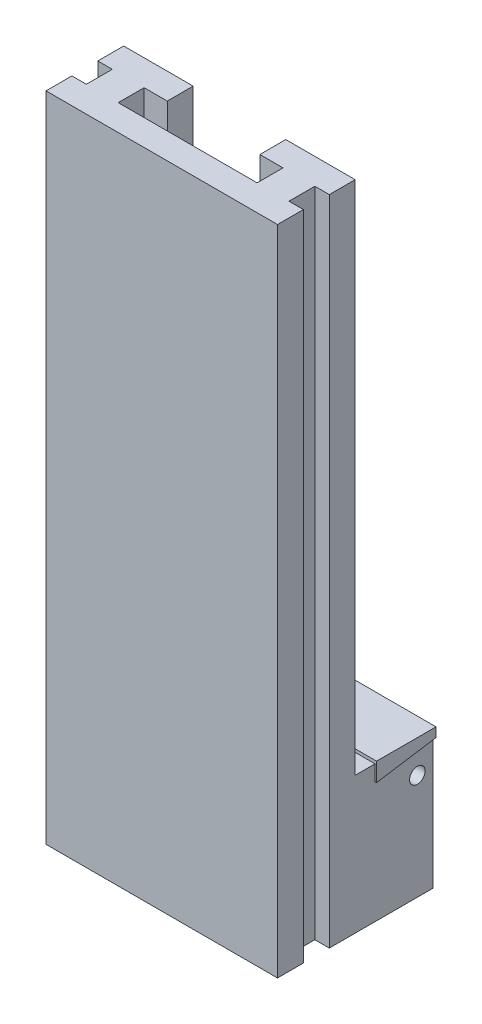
ISO-10303-21;
HEADER;
FILE_DESCRIPTION(('STEP AP214'),'2;1');
FILE_NAME('part.step','',(''),(''),'','','');
FILE_SCHEMA(('AUTOMOTIVE_DESIGN { 1 0 10303 214 1 1 1 1 }'));
ENDSEC;
DATA;
#1=APPLICATION_CONTEXT('core data for automotive mechanical design processes');
#2=APPLICATION_PROTOCOL_DEFINITION('international standard','automotive_design',2000,#1);
#3=PRODUCT_CONTEXT('',#1,'mechanical');
#4=PRODUCT('Part','Part','',(#3));
#5=PRODUCT_RELATED_PRODUCT_CATEGORY('part','',(#4));
#6=PRODUCT_DEFINITION_FORMATION('','',#4);
#7=PRODUCT_DEFINITION_CONTEXT('part definition',#1,'design');
#8=PRODUCT_DEFINITION('design','',#6,#7);
#9=PRODUCT_DEFINITION_SHAPE('','',#8);
#10=(LENGTH_UNIT() NAMED_UNIT(*) SI_UNIT(.MILLI.,.METRE.));
#11=(NAMED_UNIT(*) PLANE_ANGLE_UNIT() SI_UNIT($,.RADIAN.));
#12=(NAMED_UNIT(*) SI_UNIT($,.STERADIAN.) SOLID_ANGLE_UNIT());
#13=UNCERTAINTY_MEASURE_WITH_UNIT(LENGTH_MEASURE(1.E-05),#10,'distance_accuracy_value','');
#14=(GEOMETRIC_REPRESENTATION_CONTEXT(3) GLOBAL_UNCERTAINTY_ASSIGNED_CONTEXT((#13)) GLOBAL_UNIT_ASSIGNED_CONTEXT((#10,
#11,#12)) REPRESENTATION_CONTEXT('',''));
#15=CARTESIAN_POINT('',(0.,0.,0.));
#16=DIRECTION('',(0.,0.,1.));
#17=DIRECTION('',(1.,0.,0.));
#18=AXIS2_PLACEMENT_3D('',#15,#16,#17);
#19=CARTESIAN_POINT('',(74.5,420.,-50.));
#20=DIRECTION('',(-1.,0.,0.));
#21=DIRECTION('',(0.,0.,1.));
#22=AXIS2_PLACEMENT_3D('',#19,#20,#21);
#23=PLANE('',#22);
#24=CARTESIAN_POINT('',(74.4999999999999,68.,-90.));
#25=DIRECTION('',(-1.,0.,0.));
#26=DIRECTION('',(0.,0.,1.));
#27=AXIS2_PLACEMENT_3D('',#24,#25,#26);
#28=CIRCLE('',#27,5.00000000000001);
#29=CARTESIAN_POINT('',(74.4999999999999,68.,-85.));
#30=VERTEX_POINT('',#29);
#31=EDGE_CURVE('E244',#30,#30,#28,.T.);
#32=ORIENTED_EDGE('',*,*,#31,.T.);
#33=EDGE_LOOP('',(#32));
#34=FACE_BOUND('',#33,.T.);
#35=DIRECTION('',(0.,0.154967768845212,-0.987919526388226));
#36=VECTOR('',#35,1.);
#37=CARTESIAN_POINT('',(74.4999999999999,84.2611632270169,-102.664915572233));
#38=LINE('',#37,#36);
#39=CARTESIAN_POINT('',(74.5,78.,-62.75));
#40=VERTEX_POINT('',#39);
#41=CARTESIAN_POINT('',(74.5,83.843137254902,-100.));
#42=VERTEX_POINT('',#41);
#43=EDGE_CURVE('E46',#40,#42,#38,.T.);
#44=ORIENTED_EDGE('',*,*,#43,.F.);
#45=DIRECTION('',(0.,-1.,0.));
#46=VECTOR('',#45,1.);
#47=CARTESIAN_POINT('',(74.5,420.,-62.75));
#48=LINE('',#47,#46);
#49=CARTESIAN_POINT('',(74.5,88.,-62.75));
#50=VERTEX_POINT('',#49);
#51=EDGE_CURVE('E224',#50,#40,#48,.T.);
#52=ORIENTED_EDGE('',*,*,#51,.F.);
#53=DIRECTION('',(0.,0.,1.));
#54=VECTOR('',#53,1.);
#55=CARTESIAN_POINT('',(74.5,88.,-50.));
#56=LINE('',#55,#54);
#57=CARTESIAN_POINT('',(74.5,88.,-50.));
#58=VERTEX_POINT('',#57);
#59=EDGE_CURVE('E280',#50,#58,#56,.T.);
#60=ORIENTED_EDGE('',*,*,#59,.T.);
#61=DIRECTION('',(0.,-1.,0.));
#62=VECTOR('',#61,1.);
#63=CARTESIAN_POINT('',(74.5,420.,-50.));
#64=LINE('',#63,#62);
#65=CARTESIAN_POINT('',(74.5,420.,-50.));
#66=VERTEX_POINT('',#65);
#67=EDGE_CURVE('E406',#66,#58,#64,.T.);
#68=ORIENTED_EDGE('',*,*,#67,.F.);
#69=DIRECTION('',(0.,0.,-1.));
#70=VECTOR('',#69,1.);
#71=CARTESIAN_POINT('',(74.5,420.,-50.));
#72=LINE('',#71,#70);
#73=CARTESIAN_POINT('',(74.5,420.,-33.3333333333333));
#74=VERTEX_POINT('',#73);
#75=EDGE_CURVE('E339',#74,#66,#72,.T.);
#76=ORIENTED_EDGE('',*,*,#75,.F.);
#77=DIRECTION('',(0.,-1.,0.));
#78=VECTOR('',#77,1.);
#79=CARTESIAN_POINT('',(74.5,420.,-33.3333333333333));
#80=LINE('',#79,#78);
#81=CARTESIAN_POINT('',(74.5,0.,-33.3333333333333));
#82=VERTEX_POINT('',#81);
#83=EDGE_CURVE('E409',#74,#82,#80,.T.);
#84=ORIENTED_EDGE('',*,*,#83,.T.);
#85=DIRECTION('',(0.,0.,-1.));
#86=VECTOR('',#85,1.);
#87=CARTESIAN_POINT('',(74.5,0.,-50.));
#88=LINE('',#87,#86);
#89=CARTESIAN_POINT('',(74.5,0.,-100.));
#90=VERTEX_POINT('',#89);
#91=EDGE_CURVE('E315',#82,#90,#88,.T.);
#92=ORIENTED_EDGE('',*,*,#91,.T.);
#93=DIRECTION('',(0.,-1.,0.));
#94=VECTOR('',#93,1.);
#95=CARTESIAN_POINT('',(74.5,88.,-100.));
#96=LINE('',#95,#94);
#97=EDGE_CURVE('E299',#42,#90,#96,.T.);
#98=ORIENTED_EDGE('',*,*,#97,.F.);
#99=EDGE_LOOP('',(#44,#52,#60,#68,#76,#84,#92,#98));
#100=FACE_BOUND('',#99,.T.);
#101=ADVANCED_FACE('F31',(#34,#100),#23,.F.);
#102=CARTESIAN_POINT('',(-74.5,420.,-50.));
#103=DIRECTION('',(1.,0.,0.));
#104=DIRECTION('',(0.,0.,-1.));
#105=AXIS2_PLACEMENT_3D('',#102,#103,#104);
#106=PLANE('',#105);
#107=CARTESIAN_POINT('',(-74.5,68.,-90.));
#108=DIRECTION('',(-1.,0.,0.));
#109=DIRECTION('',(0.,0.,1.));
#110=AXIS2_PLACEMENT_3D('',#107,#108,#109);
#111=CIRCLE('',#110,5.00000000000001);
#112=CARTESIAN_POINT('',(-74.5,68.,-85.));
#113=VERTEX_POINT('',#112);
#114=EDGE_CURVE('E247',#113,#113,#111,.T.);
#115=ORIENTED_EDGE('',*,*,#114,.F.);
#116=EDGE_LOOP('',(#115));
#117=FACE_BOUND('',#116,.T.);
#118=DIRECTION('',(0.,-0.154967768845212,0.987919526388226));
#119=VECTOR('',#118,1.);
#120=CARTESIAN_POINT('',(-74.4999999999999,84.2611632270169,-102.664915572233));
#121=LINE('',#120,#119);
#122=CARTESIAN_POINT('',(-74.5,83.843137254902,-100.));
#123=VERTEX_POINT('',#122);
#124=CARTESIAN_POINT('',(-74.5,78.,-62.75));
#125=VERTEX_POINT('',#124);
#126=EDGE_CURVE('E270',#123,#125,#121,.T.);
#127=ORIENTED_EDGE('',*,*,#126,.F.);
#128=DIRECTION('',(0.,-1.,0.));
#129=VECTOR('',#128,1.);
#130=CARTESIAN_POINT('',(-74.5,88.,-100.));
#131=LINE('',#130,#129);
#132=CARTESIAN_POINT('',(-74.5,0.,-100.));
#133=VERTEX_POINT('',#132);
#134=EDGE_CURVE('E298',#123,#133,#131,.T.);
#135=ORIENTED_EDGE('',*,*,#134,.T.);
#136=DIRECTION('',(0.,0.,1.));
#137=VECTOR('',#136,1.);
#138=CARTESIAN_POINT('',(-74.5,0.,-50.));
#139=LINE('',#138,#137);
#140=CARTESIAN_POINT('',(-74.5,0.,-33.3333333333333));
#141=VERTEX_POINT('',#140);
#142=EDGE_CURVE('E318',#133,#141,#139,.T.);
#143=ORIENTED_EDGE('',*,*,#142,.T.);
#144=DIRECTION('',(0.,-1.,0.));
#145=VECTOR('',#144,1.);
#146=CARTESIAN_POINT('',(-74.5,420.,-33.3333333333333));
#147=LINE('',#146,#145);
#148=CARTESIAN_POINT('',(-74.5,420.,-33.3333333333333));
#149=VERTEX_POINT('',#148);
#150=EDGE_CURVE('E376',#149,#141,#147,.T.);
#151=ORIENTED_EDGE('',*,*,#150,.F.);
#152=DIRECTION('',(0.,0.,1.));
#153=VECTOR('',#152,1.);
#154=CARTESIAN_POINT('',(-74.5,420.,-50.));
#155=LINE('',#154,#153);
#156=CARTESIAN_POINT('',(-74.5,420.,-50.));
#157=VERTEX_POINT('',#156);
#158=EDGE_CURVE('E359',#157,#149,#155,.T.);
#159=ORIENTED_EDGE('',*,*,#158,.F.);
#160=DIRECTION('',(0.,-1.,0.));
#161=VECTOR('',#160,1.);
#162=CARTESIAN_POINT('',(-74.5,420.,-50.));
#163=LINE('',#162,#161);
#164=CARTESIAN_POINT('',(-74.5,88.,-50.));
#165=VERTEX_POINT('',#164);
#166=EDGE_CURVE('E379',#157,#165,#163,.T.);
#167=ORIENTED_EDGE('',*,*,#166,.T.);
#168=DIRECTION('',(0.,0.,-1.));
#169=VECTOR('',#168,1.);
#170=CARTESIAN_POINT('',(-74.5,88.,-50.));
#171=LINE('',#170,#169);
#172=CARTESIAN_POINT('',(-74.5,88.,-62.75));
#173=VERTEX_POINT('',#172);
#174=EDGE_CURVE('E278',#165,#173,#171,.T.);
#175=ORIENTED_EDGE('',*,*,#174,.T.);
#176=DIRECTION('',(0.,1.,0.));
#177=VECTOR('',#176,1.);
#178=CARTESIAN_POINT('',(-74.5,420.,-62.75));
#179=LINE('',#178,#177);
#180=EDGE_CURVE('E54',#125,#173,#179,.T.);
#181=ORIENTED_EDGE('',*,*,#180,.F.);
#182=EDGE_LOOP('',(#127,#135,#143,#151,#159,#167,#175,#181));
#183=FACE_BOUND('',#182,.T.);
#184=ADVANCED_FACE('F431',(#117,#183),#106,.F.);
#185=CARTESIAN_POINT('',(-74.5,88.,-100.));
#186=DIRECTION('',(0.,0.,-1.));
#187=DIRECTION('',(-1.,0.,0.));
#188=AXIS2_PLACEMENT_3D('',#185,#186,#187);
#189=PLANE('',#188);
#190=ORIENTED_EDGE('',*,*,#134,.F.);
#191=DIRECTION('',(1.,0.,0.));
#192=VECTOR('',#191,1.);
#193=CARTESIAN_POINT('',(-74.5,83.843137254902,-100.));
#194=LINE('',#193,#192);
#195=EDGE_CURVE('E11',#123,#42,#194,.T.);
#196=ORIENTED_EDGE('',*,*,#195,.T.);
#197=ORIENTED_EDGE('',*,*,#97,.T.);
#198=DIRECTION('',(1.,0.,0.));
#199=VECTOR('',#198,1.);
#200=CARTESIAN_POINT('',(-74.5,0.,-100.));
#201=LINE('',#200,#199);
#202=EDGE_CURVE('E273',#133,#90,#201,.T.);
#203=ORIENTED_EDGE('',*,*,#202,.F.);
#204=EDGE_LOOP('',(#190,#196,#197,#203));
#205=FACE_BOUND('',#204,.T.);
#206=ADVANCED_FACE('F499',(#205),#189,.T.);
#207=CARTESIAN_POINT('',(74.5,88.,-50.));
#208=DIRECTION('',(0.,-1.,0.));
#209=DIRECTION('',(0.,0.,-1.));
#210=AXIS2_PLACEMENT_3D('',#207,#208,#209);
#211=PLANE('',#210);
#212=DIRECTION('',(1.,0.,0.));
#213=VECTOR('',#212,1.);
#214=CARTESIAN_POINT('',(74.5,88.,-62.75));
#215=LINE('',#214,#213);
#216=EDGE_CURVE('E39',#173,#50,#215,.T.);
#217=ORIENTED_EDGE('',*,*,#216,.F.);
#218=ORIENTED_EDGE('',*,*,#174,.F.);
#219=DIRECTION('',(-1.,0.,0.));
#220=VECTOR('',#219,1.);
#221=CARTESIAN_POINT('',(-29.8,88.,-50.));
#222=LINE('',#221,#220);
#223=CARTESIAN_POINT('',(-29.8,88.,-50.));
#224=VERTEX_POINT('',#223);
#225=EDGE_CURVE('E276',#224,#165,#222,.T.);
#226=ORIENTED_EDGE('',*,*,#225,.F.);
#227=DIRECTION('',(0.,0.,-1.));
#228=VECTOR('',#227,1.);
#229=CARTESIAN_POINT('',(-29.8,88.,-33.3333333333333));
#230=LINE('',#229,#228);
#231=CARTESIAN_POINT('',(-29.8,88.,-33.3333333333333));
#232=VERTEX_POINT('',#231);
#233=EDGE_CURVE('E296',#232,#224,#230,.T.);
#234=ORIENTED_EDGE('',*,*,#233,.F.);
#235=DIRECTION('',(1.,0.,0.));
#236=VECTOR('',#235,1.);
#237=CARTESIAN_POINT('',(-44.7,88.,-33.3333333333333));
#238=LINE('',#237,#236);
#239=CARTESIAN_POINT('',(-44.7,88.,-33.3333333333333));
#240=VERTEX_POINT('',#239);
#241=EDGE_CURVE('E294',#240,#232,#238,.T.);
#242=ORIENTED_EDGE('',*,*,#241,.F.);
#243=DIRECTION('',(0.,0.,-1.));
#244=VECTOR('',#243,1.);
#245=CARTESIAN_POINT('',(-44.7,88.,-16.6666666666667));
#246=LINE('',#245,#244);
#247=CARTESIAN_POINT('',(-44.7,88.,-16.6666666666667));
#248=VERTEX_POINT('',#247);
#249=EDGE_CURVE('E292',#248,#240,#246,.T.);
#250=ORIENTED_EDGE('',*,*,#249,.F.);
#251=DIRECTION('',(-1.,0.,0.));
#252=VECTOR('',#251,1.);
#253=CARTESIAN_POINT('',(44.7,88.,-16.6666666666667));
#254=LINE('',#253,#252);
#255=CARTESIAN_POINT('',(44.7,88.,-16.6666666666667));
#256=VERTEX_POINT('',#255);
#257=EDGE_CURVE('E290',#256,#248,#254,.T.);
#258=ORIENTED_EDGE('',*,*,#257,.F.);
#259=DIRECTION('',(0.,0.,1.));
#260=VECTOR('',#259,1.);
#261=CARTESIAN_POINT('',(44.7,88.,-33.3333333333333));
#262=LINE('',#261,#260);
#263=CARTESIAN_POINT('',(44.7,88.,-33.3333333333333));
#264=VERTEX_POINT('',#263);
#265=EDGE_CURVE('E288',#264,#256,#262,.T.);
#266=ORIENTED_EDGE('',*,*,#265,.F.);
#267=DIRECTION('',(1.,0.,0.));
#268=VECTOR('',#267,1.);
#269=CARTESIAN_POINT('',(29.8,88.,-33.3333333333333));
#270=LINE('',#269,#268);
#271=CARTESIAN_POINT('',(29.8,88.,-33.3333333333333));
#272=VERTEX_POINT('',#271);
#273=EDGE_CURVE('E286',#272,#264,#270,.T.);
#274=ORIENTED_EDGE('',*,*,#273,.F.);
#275=DIRECTION('',(0.,0.,1.));
#276=VECTOR('',#275,1.);
#277=CARTESIAN_POINT('',(29.8,88.,-50.));
#278=LINE('',#277,#276);
#279=CARTESIAN_POINT('',(29.8,88.,-50.));
#280=VERTEX_POINT('',#279);
#281=EDGE_CURVE('E284',#280,#272,#278,.T.);
#282=ORIENTED_EDGE('',*,*,#281,.F.);
#283=DIRECTION('',(-1.,0.,0.));
#284=VECTOR('',#283,1.);
#285=CARTESIAN_POINT('',(74.5,88.,-50.));
#286=LINE('',#285,#284);
#287=EDGE_CURVE('E282',#58,#280,#286,.T.);
#288=ORIENTED_EDGE('',*,*,#287,.F.);
#289=ORIENTED_EDGE('',*,*,#59,.F.);
#290=EDGE_LOOP('',(#217,#218,#226,#234,#242,#250,#258,#266,#274,#282,#288,#289));
#291=FACE_BOUND('',#290,.T.);
#292=ADVANCED_FACE('F428',(#291),#211,.F.);
#293=CARTESIAN_POINT('',(29.8,420.,-50.));
#294=DIRECTION('',(0.,0.,1.));
#295=DIRECTION('',(1.,0.,0.));
#296=AXIS2_PLACEMENT_3D('',#293,#294,#295);
#297=PLANE('',#296);
#298=ORIENTED_EDGE('',*,*,#287,.T.);
#299=DIRECTION('',(0.,-1.,0.));
#300=VECTOR('',#299,1.);
#301=CARTESIAN_POINT('',(29.8,420.,-50.));
#302=LINE('',#301,#300);
#303=CARTESIAN_POINT('',(29.8,420.,-50.));
#304=VERTEX_POINT('',#303);
#305=EDGE_CURVE('E403',#304,#280,#302,.T.);
#306=ORIENTED_EDGE('',*,*,#305,.F.);
#307=DIRECTION('',(-1.,0.,0.));
#308=VECTOR('',#307,1.);
#309=CARTESIAN_POINT('',(29.8,420.,-50.));
#310=LINE('',#309,#308);
#311=EDGE_CURVE('E341',#66,#304,#310,.T.);
#312=ORIENTED_EDGE('',*,*,#311,.F.);
#313=ORIENTED_EDGE('',*,*,#67,.T.);
#314=EDGE_LOOP('',(#298,#306,#312,#313));
#315=FACE_BOUND('',#314,.T.);
#316=ADVANCED_FACE('F476',(#315),#297,.F.);
#317=CARTESIAN_POINT('',(29.8,420.,-33.3333333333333));
#318=DIRECTION('',(1.,0.,0.));
#319=DIRECTION('',(0.,0.,-1.));
#320=AXIS2_PLACEMENT_3D('',#317,#318,#319);
#321=PLANE('',#320);
#322=ORIENTED_EDGE('',*,*,#281,.T.);
#323=DIRECTION('',(0.,-1.,0.));
#324=VECTOR('',#323,1.);
#325=CARTESIAN_POINT('',(29.8,420.,-33.3333333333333));
#326=LINE('',#325,#324);
#327=CARTESIAN_POINT('',(29.8,420.,-33.3333333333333));
#328=VERTEX_POINT('',#327);
#329=EDGE_CURVE('E400',#328,#272,#326,.T.);
#330=ORIENTED_EDGE('',*,*,#329,.F.);
#331=DIRECTION('',(0.,0.,1.));
#332=VECTOR('',#331,1.);
#333=CARTESIAN_POINT('',(29.8,420.,-33.3333333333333));
#334=LINE('',#333,#332);
#335=EDGE_CURVE('E343',#304,#328,#334,.T.);
#336=ORIENTED_EDGE('',*,*,#335,.F.);
#337=ORIENTED_EDGE('',*,*,#305,.T.);
#338=EDGE_LOOP('',(#322,#330,#336,#337));
#339=FACE_BOUND('',#338,.T.);
#340=ADVANCED_FACE('F471',(#339),#321,.F.);
#341=CARTESIAN_POINT('',(44.7,420.,-33.3333333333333));
#342=DIRECTION('',(0.,0.,-1.));
#343=DIRECTION('',(-1.,0.,0.));
#344=AXIS2_PLACEMENT_3D('',#341,#342,#343);
#345=PLANE('',#344);
#346=ORIENTED_EDGE('',*,*,#273,.T.);
#347=DIRECTION('',(0.,-1.,0.));
#348=VECTOR('',#347,1.);
#349=CARTESIAN_POINT('',(44.7,420.,-33.3333333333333));
#350=LINE('',#349,#348);
#351=CARTESIAN_POINT('',(44.7,420.,-33.3333333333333));
#352=VERTEX_POINT('',#351);
#353=EDGE_CURVE('E397',#352,#264,#350,.T.);
#354=ORIENTED_EDGE('',*,*,#353,.F.);
#355=DIRECTION('',(1.,0.,0.));
#356=VECTOR('',#355,1.);
#357=CARTESIAN_POINT('',(44.7,420.,-33.3333333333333));
#358=LINE('',#357,#356);
#359=EDGE_CURVE('E345',#328,#352,#358,.T.);
#360=ORIENTED_EDGE('',*,*,#359,.F.);
#361=ORIENTED_EDGE('',*,*,#329,.T.);
#362=EDGE_LOOP('',(#346,#354,#360,#361));
#363=FACE_BOUND('',#362,.T.);
#364=ADVANCED_FACE('F467',(#363),#345,.F.);
#365=CARTESIAN_POINT('',(44.7,420.,-16.6666666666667));
#366=DIRECTION('',(1.,0.,0.));
#367=DIRECTION('',(0.,0.,-1.));
#368=AXIS2_PLACEMENT_3D('',#365,#366,#367);
#369=PLANE('',#368);
#370=ORIENTED_EDGE('',*,*,#265,.T.);
#371=DIRECTION('',(0.,-1.,0.));
#372=VECTOR('',#371,1.);
#373=CARTESIAN_POINT('',(44.7,420.,-16.6666666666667));
#374=LINE('',#373,#372);
#375=CARTESIAN_POINT('',(44.7,420.,-16.6666666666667));
#376=VERTEX_POINT('',#375);
#377=EDGE_CURVE('E394',#376,#256,#374,.T.);
#378=ORIENTED_EDGE('',*,*,#377,.F.);
#379=DIRECTION('',(0.,0.,1.));
#380=VECTOR('',#379,1.);
#381=CARTESIAN_POINT('',(44.7,420.,-16.6666666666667));
#382=LINE('',#381,#380);
#383=EDGE_CURVE('E347',#352,#376,#382,.T.);
#384=ORIENTED_EDGE('',*,*,#383,.F.);
#385=ORIENTED_EDGE('',*,*,#353,.T.);
#386=EDGE_LOOP('',(#370,#378,#384,#385));
#387=FACE_BOUND('',#386,.T.);
#388=ADVANCED_FACE('F463',(#387),#369,.F.);
#389=CARTESIAN_POINT('',(44.7,420.,-16.6666666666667));
#390=DIRECTION('',(0.,0.,1.));
#391=DIRECTION('',(1.,0.,0.));
#392=AXIS2_PLACEMENT_3D('',#389,#390,#391);
#393=PLANE('',#392);
#394=ORIENTED_EDGE('',*,*,#257,.T.);
#395=DIRECTION('',(0.,-1.,0.));
#396=VECTOR('',#395,1.);
#397=CARTESIAN_POINT('',(-44.7,420.,-16.6666666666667));
#398=LINE('',#397,#396);
#399=CARTESIAN_POINT('',(-44.7,420.,-16.6666666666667));
#400=VERTEX_POINT('',#399);
#401=EDGE_CURVE('E391',#400,#248,#398,.T.);
#402=ORIENTED_EDGE('',*,*,#401,.F.);
#403=DIRECTION('',(-1.,0.,0.));
#404=VECTOR('',#403,1.);
#405=CARTESIAN_POINT('',(44.7,420.,-16.6666666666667));
#406=LINE('',#405,#404);
#407=EDGE_CURVE('E349',#376,#400,#406,.T.);
#408=ORIENTED_EDGE('',*,*,#407,.F.);
#409=ORIENTED_EDGE('',*,*,#377,.T.);
#410=EDGE_LOOP('',(#394,#402,#408,#409));
#411=FACE_BOUND('',#410,.T.);
#412=ADVANCED_FACE('F458',(#411),#393,.F.);
#413=CARTESIAN_POINT('',(-44.7,420.,-16.6666666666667));
#414=DIRECTION('',(-1.,0.,0.));
#415=DIRECTION('',(0.,0.,1.));
#416=AXIS2_PLACEMENT_3D('',#413,#414,#415);
#417=PLANE('',#416);
#418=ORIENTED_EDGE('',*,*,#249,.T.);
#419=DIRECTION('',(0.,-1.,0.));
#420=VECTOR('',#419,1.);
#421=CARTESIAN_POINT('',(-44.7,420.,-33.3333333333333));
#422=LINE('',#421,#420);
#423=CARTESIAN_POINT('',(-44.7,420.,-33.3333333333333));
#424=VERTEX_POINT('',#423);
#425=EDGE_CURVE('E388',#424,#240,#422,.T.);
#426=ORIENTED_EDGE('',*,*,#425,.F.);
#427=DIRECTION('',(0.,0.,-1.));
#428=VECTOR('',#427,1.);
#429=CARTESIAN_POINT('',(-44.7,420.,-16.6666666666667));
#430=LINE('',#429,#428);
#431=EDGE_CURVE('E351',#400,#424,#430,.T.);
#432=ORIENTED_EDGE('',*,*,#431,.F.);
#433=ORIENTED_EDGE('',*,*,#401,.T.);
#434=EDGE_LOOP('',(#418,#426,#432,#433));
#435=FACE_BOUND('',#434,.T.);
#436=ADVANCED_FACE('F452',(#435),#417,.F.);
#437=CARTESIAN_POINT('',(-44.7,420.,-33.3333333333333));
#438=DIRECTION('',(0.,0.,-1.));
#439=DIRECTION('',(-1.,0.,0.));
#440=AXIS2_PLACEMENT_3D('',#437,#438,#439);
#441=PLANE('',#440);
#442=ORIENTED_EDGE('',*,*,#241,.T.);
#443=DIRECTION('',(0.,-1.,0.));
#444=VECTOR('',#443,1.);
#445=CARTESIAN_POINT('',(-29.8,420.,-33.3333333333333));
#446=LINE('',#445,#444);
#447=CARTESIAN_POINT('',(-29.8,420.,-33.3333333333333));
#448=VERTEX_POINT('',#447);
#449=EDGE_CURVE('E385',#448,#232,#446,.T.);
#450=ORIENTED_EDGE('',*,*,#449,.F.);
#451=DIRECTION('',(1.,0.,0.));
#452=VECTOR('',#451,1.);
#453=CARTESIAN_POINT('',(-44.7,420.,-33.3333333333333));
#454=LINE('',#453,#452);
#455=EDGE_CURVE('E353',#424,#448,#454,.T.);
#456=ORIENTED_EDGE('',*,*,#455,.F.);
#457=ORIENTED_EDGE('',*,*,#425,.T.);
#458=EDGE_LOOP('',(#442,#450,#456,#457));
#459=FACE_BOUND('',#458,.T.);
#460=ADVANCED_FACE('F448',(#459),#441,.F.);
#461=CARTESIAN_POINT('',(-29.8,420.,-33.3333333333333));
#462=DIRECTION('',(-1.,0.,0.));
#463=DIRECTION('',(0.,0.,1.));
#464=AXIS2_PLACEMENT_3D('',#461,#462,#463);
#465=PLANE('',#464);
#466=ORIENTED_EDGE('',*,*,#233,.T.);
#467=DIRECTION('',(0.,-1.,0.));
#468=VECTOR('',#467,1.);
#469=CARTESIAN_POINT('',(-29.8,420.,-50.));
#470=LINE('',#469,#468);
#471=CARTESIAN_POINT('',(-29.8,420.,-50.));
#472=VERTEX_POINT('',#471);
#473=EDGE_CURVE('E382',#472,#224,#470,.T.);
#474=ORIENTED_EDGE('',*,*,#473,.F.);
#475=DIRECTION('',(0.,0.,-1.));
#476=VECTOR('',#475,1.);
#477=CARTESIAN_POINT('',(-29.8,420.,-33.3333333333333));
#478=LINE('',#477,#476);
#479=EDGE_CURVE('E355',#448,#472,#478,.T.);
#480=ORIENTED_EDGE('',*,*,#479,.F.);
#481=ORIENTED_EDGE('',*,*,#449,.T.);
#482=EDGE_LOOP('',(#466,#474,#480,#481));
#483=FACE_BOUND('',#482,.T.);
#484=ADVANCED_FACE('F443',(#483),#465,.F.);
#485=CARTESIAN_POINT('',(-29.8,420.,-50.));
#486=DIRECTION('',(0.,0.,1.));
#487=DIRECTION('',(1.,0.,0.));
#488=AXIS2_PLACEMENT_3D('',#485,#486,#487);
#489=PLANE('',#488);
#490=ORIENTED_EDGE('',*,*,#225,.T.);
#491=ORIENTED_EDGE('',*,*,#166,.F.);
#492=DIRECTION('',(-1.,0.,0.));
#493=VECTOR('',#492,1.);
#494=CARTESIAN_POINT('',(-29.8,420.,-50.));
#495=LINE('',#494,#493);
#496=EDGE_CURVE('E357',#472,#157,#495,.T.);
#497=ORIENTED_EDGE('',*,*,#496,.F.);
#498=ORIENTED_EDGE('',*,*,#473,.T.);
#499=EDGE_LOOP('',(#490,#491,#497,#498));
#500=FACE_BOUND('',#499,.T.);
#501=ADVANCED_FACE('F437',(#500),#489,.F.);
#502=CARTESIAN_POINT('',(-74.5,420.,-16.6666666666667));
#503=DIRECTION('',(1.,0.,0.));
#504=DIRECTION('',(0.,0.,-1.));
#505=AXIS2_PLACEMENT_3D('',#502,#503,#504);
#506=PLANE('',#505);
#507=DIRECTION('',(0.,0.,1.));
#508=VECTOR('',#507,1.);
#509=CARTESIAN_POINT('',(-74.5,0.,-16.6666666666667));
#510=LINE('',#509,#508);
#511=CARTESIAN_POINT('',(-74.5,0.,-16.6666666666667));
#512=VERTEX_POINT('',#511);
#513=CARTESIAN_POINT('',(-74.5,0.,0.));
#514=VERTEX_POINT('',#513);
#515=EDGE_CURVE('E301',#512,#514,#510,.T.);
#516=ORIENTED_EDGE('',*,*,#515,.T.);
#517=DIRECTION('',(0.,-1.,0.));
#518=VECTOR('',#517,1.);
#519=CARTESIAN_POINT('',(-74.5,420.,0.));
#520=LINE('',#519,#518);
#521=CARTESIAN_POINT('',(-74.5,420.,0.));
#522=VERTEX_POINT('',#521);
#523=EDGE_CURVE('E424',#522,#514,#520,.T.);
#524=ORIENTED_EDGE('',*,*,#523,.F.);
#525=DIRECTION('',(0.,0.,1.));
#526=VECTOR('',#525,1.);
#527=CARTESIAN_POINT('',(-74.5,420.,-16.6666666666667));
#528=LINE('',#527,#526);
#529=CARTESIAN_POINT('',(-74.5,420.,-16.6666666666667));
#530=VERTEX_POINT('',#529);
#531=EDGE_CURVE('E326',#530,#522,#528,.T.);
#532=ORIENTED_EDGE('',*,*,#531,.F.);
#533=DIRECTION('',(0.,-1.,0.));
#534=VECTOR('',#533,1.);
#535=CARTESIAN_POINT('',(-74.5,420.,-16.6666666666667));
#536=LINE('',#535,#534);
#537=EDGE_CURVE('E367',#530,#512,#536,.T.);
#538=ORIENTED_EDGE('',*,*,#537,.T.);
#539=EDGE_LOOP('',(#516,#524,#532,#538));
#540=FACE_BOUND('',#539,.T.);
#541=ADVANCED_FACE('F33',(#540),#506,.F.);
#542=CARTESIAN_POINT('',(-74.5,420.,0.));
#543=DIRECTION('',(0.,0.,-1.));
#544=DIRECTION('',(-1.,0.,0.));
#545=AXIS2_PLACEMENT_3D('',#542,#543,#544);
#546=PLANE('',#545);
#547=DIRECTION('',(1.,0.,0.));
#548=VECTOR('',#547,1.);
#549=CARTESIAN_POINT('',(-74.5,0.,0.));
#550=LINE('',#549,#548);
#551=CARTESIAN_POINT('',(74.5,0.,0.));
#552=VERTEX_POINT('',#551);
#553=EDGE_CURVE('E305',#514,#552,#550,.T.);
#554=ORIENTED_EDGE('',*,*,#553,.T.);
#555=DIRECTION('',(0.,-1.,0.));
#556=VECTOR('',#555,1.);
#557=CARTESIAN_POINT('',(74.5,420.,0.));
#558=LINE('',#557,#556);
#559=CARTESIAN_POINT('',(74.5,420.,0.));
#560=VERTEX_POINT('',#559);
#561=EDGE_CURVE('E421',#560,#552,#558,.T.);
#562=ORIENTED_EDGE('',*,*,#561,.F.);
#563=DIRECTION('',(1.,0.,0.));
#564=VECTOR('',#563,1.);
#565=CARTESIAN_POINT('',(-74.5,420.,0.));
#566=LINE('',#565,#564);
#567=EDGE_CURVE('E329',#522,#560,#566,.T.);
#568=ORIENTED_EDGE('',*,*,#567,.F.);
#569=ORIENTED_EDGE('',*,*,#523,.T.);
#570=EDGE_LOOP('',(#554,#562,#568,#569));
#571=FACE_BOUND('',#570,.T.);
#572=ADVANCED_FACE('F520',(#571),#546,.F.);
#573=CARTESIAN_POINT('',(74.5,420.,-16.6666666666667));
#574=DIRECTION('',(-1.,0.,0.));
#575=DIRECTION('',(0.,0.,1.));
#576=AXIS2_PLACEMENT_3D('',#573,#574,#575);
#577=PLANE('',#576);
#578=DIRECTION('',(0.,0.,-1.));
#579=VECTOR('',#578,1.);
#580=CARTESIAN_POINT('',(74.5,0.,-16.6666666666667));
#581=LINE('',#580,#579);
#582=CARTESIAN_POINT('',(74.5,0.,-16.6666666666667));
#583=VERTEX_POINT('',#582);
#584=EDGE_CURVE('E307',#552,#583,#581,.T.);
#585=ORIENTED_EDGE('',*,*,#584,.T.);
#586=DIRECTION('',(0.,-1.,0.));
#587=VECTOR('',#586,1.);
#588=CARTESIAN_POINT('',(74.5,420.,-16.6666666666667));
#589=LINE('',#588,#587);
#590=CARTESIAN_POINT('',(74.5,420.,-16.6666666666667));
#591=VERTEX_POINT('',#590);
#592=EDGE_CURVE('E418',#591,#583,#589,.T.);
#593=ORIENTED_EDGE('',*,*,#592,.F.);
#594=DIRECTION('',(0.,0.,-1.));
#595=VECTOR('',#594,1.);
#596=CARTESIAN_POINT('',(74.5,420.,-16.6666666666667));
#597=LINE('',#596,#595);
#598=EDGE_CURVE('E331',#560,#591,#597,.T.);
#599=ORIENTED_EDGE('',*,*,#598,.F.);
#600=ORIENTED_EDGE('',*,*,#561,.T.);
#601=EDGE_LOOP('',(#585,#593,#599,#600));
#602=FACE_BOUND('',#601,.T.);
#603=ADVANCED_FACE('F527',(#602),#577,.F.);
#604=CARTESIAN_POINT('',(65.1875,420.,-16.6666666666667));
#605=DIRECTION('',(0.,0.,1.));
#606=DIRECTION('',(1.,0.,0.));
#607=AXIS2_PLACEMENT_3D('',#604,#605,#606);
#608=PLANE('',#607);
#609=DIRECTION('',(-1.,0.,0.));
#610=VECTOR('',#609,1.);
#611=CARTESIAN_POINT('',(65.1875,0.,-16.6666666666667));
#612=LINE('',#611,#610);
#613=CARTESIAN_POINT('',(65.1875,0.,-16.6666666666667));
#614=VERTEX_POINT('',#613);
#615=EDGE_CURVE('E309',#583,#614,#612,.T.);
#616=ORIENTED_EDGE('',*,*,#615,.T.);
#617=DIRECTION('',(0.,-1.,0.));
#618=VECTOR('',#617,1.);
#619=CARTESIAN_POINT('',(65.1875,420.,-16.6666666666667));
#620=LINE('',#619,#618);
#621=CARTESIAN_POINT('',(65.1875,420.,-16.6666666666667));
#622=VERTEX_POINT('',#621);
#623=EDGE_CURVE('E415',#622,#614,#620,.T.);
#624=ORIENTED_EDGE('',*,*,#623,.F.);
#625=DIRECTION('',(-1.,0.,0.));
#626=VECTOR('',#625,1.);
#627=CARTESIAN_POINT('',(65.1875,420.,-16.6666666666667));
#628=LINE('',#627,#626);
#629=EDGE_CURVE('E333',#591,#622,#628,.T.);
#630=ORIENTED_EDGE('',*,*,#629,.F.);
#631=ORIENTED_EDGE('',*,*,#592,.T.);
#632=EDGE_LOOP('',(#616,#624,#630,#631));
#633=FACE_BOUND('',#632,.T.);
#634=ADVANCED_FACE('F530',(#633),#608,.F.);
#635=CARTESIAN_POINT('',(65.1875,420.,-33.3333333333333));
#636=DIRECTION('',(-1.,0.,0.));
#637=DIRECTION('',(0.,0.,1.));
#638=AXIS2_PLACEMENT_3D('',#635,#636,#637);
#639=PLANE('',#638);
#640=DIRECTION('',(0.,0.,-1.));
#641=VECTOR('',#640,1.);
#642=CARTESIAN_POINT('',(65.1875,0.,-33.3333333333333));
#643=LINE('',#642,#641);
#644=CARTESIAN_POINT('',(65.1875,0.,-33.3333333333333));
#645=VERTEX_POINT('',#644);
#646=EDGE_CURVE('E311',#614,#645,#643,.T.);
#647=ORIENTED_EDGE('',*,*,#646,.T.);
#648=DIRECTION('',(0.,-1.,0.));
#649=VECTOR('',#648,1.);
#650=CARTESIAN_POINT('',(65.1875,420.,-33.3333333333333));
#651=LINE('',#650,#649);
#652=CARTESIAN_POINT('',(65.1875,420.,-33.3333333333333));
#653=VERTEX_POINT('',#652);
#654=EDGE_CURVE('E412',#653,#645,#651,.T.);
#655=ORIENTED_EDGE('',*,*,#654,.F.);
#656=DIRECTION('',(0.,0.,-1.));
#657=VECTOR('',#656,1.);
#658=CARTESIAN_POINT('',(65.1875,420.,-33.3333333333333));
#659=LINE('',#658,#657);
#660=EDGE_CURVE('E335',#622,#653,#659,.T.);
#661=ORIENTED_EDGE('',*,*,#660,.F.);
#662=ORIENTED_EDGE('',*,*,#623,.T.);
#663=EDGE_LOOP('',(#647,#655,#661,#662));
#664=FACE_BOUND('',#663,.T.);
#665=ADVANCED_FACE('F532',(#664),#639,.F.);
#666=CARTESIAN_POINT('',(74.5,420.,-33.3333333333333));
#667=DIRECTION('',(0.,0.,-1.));
#668=DIRECTION('',(-1.,0.,0.));
#669=AXIS2_PLACEMENT_3D('',#666,#667,#668);
#670=PLANE('',#669);
#671=DIRECTION('',(1.,0.,0.));
#672=VECTOR('',#671,1.);
#673=CARTESIAN_POINT('',(74.5,0.,-33.3333333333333));
#674=LINE('',#673,#672);
#675=EDGE_CURVE('E313',#645,#82,#674,.T.);
#676=ORIENTED_EDGE('',*,*,#675,.T.);
#677=ORIENTED_EDGE('',*,*,#83,.F.);
#678=DIRECTION('',(1.,0.,0.));
#679=VECTOR('',#678,1.);
#680=CARTESIAN_POINT('',(74.5,420.,-33.3333333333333));
#681=LINE('',#680,#679);
#682=EDGE_CURVE('E337',#653,#74,#681,.T.);
#683=ORIENTED_EDGE('',*,*,#682,.F.);
#684=ORIENTED_EDGE('',*,*,#654,.T.);
#685=EDGE_LOOP('',(#676,#677,#683,#684));
#686=FACE_BOUND('',#685,.T.);
#687=ADVANCED_FACE('F487',(#686),#670,.F.);
#688=CARTESIAN_POINT('',(-74.5,420.,-33.3333333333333));
#689=DIRECTION('',(0.,0.,-1.));
#690=DIRECTION('',(-1.,0.,0.));
#691=AXIS2_PLACEMENT_3D('',#688,#689,#690);
#692=PLANE('',#691);
#693=DIRECTION('',(1.,0.,0.));
#694=VECTOR('',#693,1.);
#695=CARTESIAN_POINT('',(-74.5,0.,-33.3333333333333));
#696=LINE('',#695,#694);
#697=CARTESIAN_POINT('',(-65.1875,0.,-33.3333333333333));
#698=VERTEX_POINT('',#697);
#699=EDGE_CURVE('E320',#141,#698,#696,.T.);
#700=ORIENTED_EDGE('',*,*,#699,.T.);
#701=DIRECTION('',(0.,-1.,0.));
#702=VECTOR('',#701,1.);
#703=CARTESIAN_POINT('',(-65.1875,420.,-33.3333333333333));
#704=LINE('',#703,#702);
#705=CARTESIAN_POINT('',(-65.1875,420.,-33.3333333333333));
#706=VERTEX_POINT('',#705);
#707=EDGE_CURVE('E373',#706,#698,#704,.T.);
#708=ORIENTED_EDGE('',*,*,#707,.F.);
#709=DIRECTION('',(1.,0.,0.));
#710=VECTOR('',#709,1.);
#711=CARTESIAN_POINT('',(-74.5,420.,-33.3333333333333));
#712=LINE('',#711,#710);
#713=EDGE_CURVE('E361',#149,#706,#712,.T.);
#714=ORIENTED_EDGE('',*,*,#713,.F.);
#715=ORIENTED_EDGE('',*,*,#150,.T.);
#716=EDGE_LOOP('',(#700,#708,#714,#715));
#717=FACE_BOUND('',#716,.T.);
#718=ADVANCED_FACE('F505',(#717),#692,.F.);
#719=CARTESIAN_POINT('',(-65.1875,420.,-33.3333333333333));
#720=DIRECTION('',(1.,0.,0.));
#721=DIRECTION('',(0.,0.,-1.));
#722=AXIS2_PLACEMENT_3D('',#719,#720,#721);
#723=PLANE('',#722);
#724=DIRECTION('',(0.,0.,1.));
#725=VECTOR('',#724,1.);
#726=CARTESIAN_POINT('',(-65.1875,0.,-33.3333333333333));
#727=LINE('',#726,#725);
#728=CARTESIAN_POINT('',(-65.1875,0.,-16.6666666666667));
#729=VERTEX_POINT('',#728);
#730=EDGE_CURVE('E322',#698,#729,#727,.T.);
#731=ORIENTED_EDGE('',*,*,#730,.T.);
#732=DIRECTION('',(0.,-1.,0.));
#733=VECTOR('',#732,1.);
#734=CARTESIAN_POINT('',(-65.1875,420.,-16.6666666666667));
#735=LINE('',#734,#733);
#736=CARTESIAN_POINT('',(-65.1875,420.,-16.6666666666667));
#737=VERTEX_POINT('',#736);
#738=EDGE_CURVE('E370',#737,#729,#735,.T.);
#739=ORIENTED_EDGE('',*,*,#738,.F.);
#740=DIRECTION('',(0.,0.,1.));
#741=VECTOR('',#740,1.);
#742=CARTESIAN_POINT('',(-65.1875,420.,-33.3333333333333));
#743=LINE('',#742,#741);
#744=EDGE_CURVE('E363',#706,#737,#743,.T.);
#745=ORIENTED_EDGE('',*,*,#744,.F.);
#746=ORIENTED_EDGE('',*,*,#707,.T.);
#747=EDGE_LOOP('',(#731,#739,#745,#746));
#748=FACE_BOUND('',#747,.T.);
#749=ADVANCED_FACE('F509',(#748),#723,.F.);
#750=CARTESIAN_POINT('',(-65.1875,420.,-16.6666666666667));
#751=DIRECTION('',(0.,0.,1.));
#752=DIRECTION('',(1.,0.,0.));
#753=AXIS2_PLACEMENT_3D('',#750,#751,#752);
#754=PLANE('',#753);
#755=DIRECTION('',(-1.,0.,0.));
#756=VECTOR('',#755,1.);
#757=CARTESIAN_POINT('',(-65.1875,0.,-16.6666666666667));
#758=LINE('',#757,#756);
#759=EDGE_CURVE('E324',#729,#512,#758,.T.);
#760=ORIENTED_EDGE('',*,*,#759,.T.);
#761=ORIENTED_EDGE('',*,*,#537,.F.);
#762=DIRECTION('',(-1.,0.,0.));
#763=VECTOR('',#762,1.);
#764=CARTESIAN_POINT('',(-65.1875,420.,-16.6666666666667));
#765=LINE('',#764,#763);
#766=EDGE_CURVE('E365',#737,#530,#765,.T.);
#767=ORIENTED_EDGE('',*,*,#766,.F.);
#768=ORIENTED_EDGE('',*,*,#738,.T.);
#769=EDGE_LOOP('',(#760,#761,#767,#768));
#770=FACE_BOUND('',#769,.T.);
#771=ADVANCED_FACE('F516',(#770),#754,.F.);
#772=CARTESIAN_POINT('',(-74.5,420.,0.));
#773=DIRECTION('',(0.,1.,0.));
#774=DIRECTION('',(0.,0.,1.));
#775=AXIS2_PLACEMENT_3D('',#772,#773,#774);
#776=PLANE('',#775);
#777=ORIENTED_EDGE('',*,*,#531,.T.);
#778=ORIENTED_EDGE('',*,*,#567,.T.);
#779=ORIENTED_EDGE('',*,*,#598,.T.);
#780=ORIENTED_EDGE('',*,*,#629,.T.);
#781=ORIENTED_EDGE('',*,*,#660,.T.);
#782=ORIENTED_EDGE('',*,*,#682,.T.);
#783=ORIENTED_EDGE('',*,*,#75,.T.);
#784=ORIENTED_EDGE('',*,*,#311,.T.);
#785=ORIENTED_EDGE('',*,*,#335,.T.);
#786=ORIENTED_EDGE('',*,*,#359,.T.);
#787=ORIENTED_EDGE('',*,*,#383,.T.);
#788=ORIENTED_EDGE('',*,*,#407,.T.);
#789=ORIENTED_EDGE('',*,*,#431,.T.);
#790=ORIENTED_EDGE('',*,*,#455,.T.);
#791=ORIENTED_EDGE('',*,*,#479,.T.);
#792=ORIENTED_EDGE('',*,*,#496,.T.);
#793=ORIENTED_EDGE('',*,*,#158,.T.);
#794=ORIENTED_EDGE('',*,*,#713,.T.);
#795=ORIENTED_EDGE('',*,*,#744,.T.);
#796=ORIENTED_EDGE('',*,*,#766,.T.);
#797=EDGE_LOOP('',(#777,#778,#779,#780,#781,#782,#783,#784,#785,#786,#787,#788,#789,#790,#791,
#792,#793,#794,#795,#796));
#798=FACE_BOUND('',#797,.T.);
#799=ADVANCED_FACE('F482',(#798),#776,.T.);
#800=CARTESIAN_POINT('',(-74.5,0.,0.));
#801=DIRECTION('',(0.,1.,0.));
#802=DIRECTION('',(0.,0.,1.));
#803=AXIS2_PLACEMENT_3D('',#800,#801,#802);
#804=PLANE('',#803);
#805=ORIENTED_EDGE('',*,*,#142,.F.);
#806=ORIENTED_EDGE('',*,*,#202,.T.);
#807=ORIENTED_EDGE('',*,*,#91,.F.);
#808=ORIENTED_EDGE('',*,*,#675,.F.);
#809=ORIENTED_EDGE('',*,*,#646,.F.);
#810=ORIENTED_EDGE('',*,*,#615,.F.);
#811=ORIENTED_EDGE('',*,*,#584,.F.);
#812=ORIENTED_EDGE('',*,*,#553,.F.);
#813=ORIENTED_EDGE('',*,*,#515,.F.);
#814=ORIENTED_EDGE('',*,*,#759,.F.);
#815=ORIENTED_EDGE('',*,*,#730,.F.);
#816=ORIENTED_EDGE('',*,*,#699,.F.);
#817=EDGE_LOOP('',(#805,#806,#807,#808,#809,#810,#811,#812,#813,#814,#815,#816));
#818=FACE_BOUND('',#817,.T.);
#819=ADVANCED_FACE('F492',(#818),#804,.F.);
#820=CARTESIAN_POINT('',(-75.5,78.,-62.75));
#821=DIRECTION('',(0.,0.987919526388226,0.154967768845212));
#822=DIRECTION('',(0.,-0.154967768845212,0.987919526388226));
#823=AXIS2_PLACEMENT_3D('',#820,#821,#822);
#824=PLANE('',#823);
#825=DIRECTION('',(1.,0.,0.));
#826=VECTOR('',#825,1.);
#827=CARTESIAN_POINT('',(-75.5,78.,-62.75));
#828=LINE('',#827,#826);
#829=CARTESIAN_POINT('',(75.5,78.,-62.75));
#830=VERTEX_POINT('',#829);
#831=EDGE_CURVE('E218',#40,#830,#828,.T.);
#832=ORIENTED_EDGE('',*,*,#831,.F.);
#833=ORIENTED_EDGE('',*,*,#43,.T.);
#834=ORIENTED_EDGE('',*,*,#195,.F.);
#835=ORIENTED_EDGE('',*,*,#126,.T.);
#836=CARTESIAN_POINT('',(-75.5,78.,-62.75));
#837=VERTEX_POINT('',#836);
#838=EDGE_CURVE('E227',#837,#125,#828,.T.);
#839=ORIENTED_EDGE('',*,*,#838,.F.);
#840=DIRECTION('',(0.,-0.154967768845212,0.987919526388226));
#841=VECTOR('',#840,1.);
#842=CARTESIAN_POINT('',(-75.5,78.,-62.75));
#843=LINE('',#842,#841);
#844=CARTESIAN_POINT('',(-75.5,84.,-101.));
#845=VERTEX_POINT('',#844);
#846=EDGE_CURVE('E254',#845,#837,#843,.T.);
#847=ORIENTED_EDGE('',*,*,#846,.F.);
#848=DIRECTION('',(1.,0.,0.));
#849=VECTOR('',#848,1.);
#850=CARTESIAN_POINT('',(-75.5,84.,-101.));
#851=LINE('',#850,#849);
#852=CARTESIAN_POINT('',(75.5,84.,-101.));
#853=VERTEX_POINT('',#852);
#854=EDGE_CURVE('E243',#845,#853,#851,.T.);
#855=ORIENTED_EDGE('',*,*,#854,.T.);
#856=DIRECTION('',(0.,-0.154967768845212,0.987919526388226));
#857=VECTOR('',#856,1.);
#858=CARTESIAN_POINT('',(75.5,78.,-62.75));
#859=LINE('',#858,#857);
#860=EDGE_CURVE('E235',#853,#830,#859,.T.);
#861=ORIENTED_EDGE('',*,*,#860,.T.);
#862=EDGE_LOOP('',(#832,#833,#834,#835,#839,#847,#855,#861));
#863=FACE_BOUND('',#862,.T.);
#864=ADVANCED_FACE('F240',(#863),#824,.F.);
#865=CARTESIAN_POINT('',(-75.5,90.,-62.75));
#866=DIRECTION('',(0.,0.,-1.));
#867=DIRECTION('',(-1.,0.,0.));
#868=AXIS2_PLACEMENT_3D('',#865,#866,#867);
#869=PLANE('',#868);
#870=ORIENTED_EDGE('',*,*,#216,.T.);
#871=ORIENTED_EDGE('',*,*,#51,.T.);
#872=ORIENTED_EDGE('',*,*,#831,.T.);
#873=DIRECTION('',(0.,1.,0.));
#874=VECTOR('',#873,1.);
#875=CARTESIAN_POINT('',(75.5,90.,-62.75));
#876=LINE('',#875,#874);
#877=CARTESIAN_POINT('',(75.5,90.,-62.75));
#878=VERTEX_POINT('',#877);
#879=EDGE_CURVE('E223',#830,#878,#876,.T.);
#880=ORIENTED_EDGE('',*,*,#879,.T.);
#881=DIRECTION('',(1.,0.,0.));
#882=VECTOR('',#881,1.);
#883=CARTESIAN_POINT('',(-75.5,90.,-62.75));
#884=LINE('',#883,#882);
#885=CARTESIAN_POINT('',(-75.5,90.,-62.75));
#886=VERTEX_POINT('',#885);
#887=EDGE_CURVE('E228',#886,#878,#884,.T.);
#888=ORIENTED_EDGE('',*,*,#887,.F.);
#889=DIRECTION('',(0.,1.,0.));
#890=VECTOR('',#889,1.);
#891=CARTESIAN_POINT('',(-75.5,90.,-62.75));
#892=LINE('',#891,#890);
#893=EDGE_CURVE('E257',#837,#886,#892,.T.);
#894=ORIENTED_EDGE('',*,*,#893,.F.);
#895=ORIENTED_EDGE('',*,*,#838,.T.);
#896=ORIENTED_EDGE('',*,*,#180,.T.);
#897=EDGE_LOOP('',(#870,#871,#872,#880,#888,#894,#895,#896));
#898=FACE_BOUND('',#897,.T.);
#899=ADVANCED_FACE('F221',(#898),#869,.F.);
#900=CARTESIAN_POINT('',(-75.5,90.,-101.));
#901=DIRECTION('',(0.,-1.,0.));
#902=DIRECTION('',(0.,0.,-1.));
#903=AXIS2_PLACEMENT_3D('',#900,#901,#902);
#904=PLANE('',#903);
#905=ORIENTED_EDGE('',*,*,#887,.T.);
#906=DIRECTION('',(0.,0.,-1.));
#907=VECTOR('',#906,1.);
#908=CARTESIAN_POINT('',(75.5,90.,-101.));
#909=LINE('',#908,#907);
#910=CARTESIAN_POINT('',(75.5,90.,-101.));
#911=VERTEX_POINT('',#910);
#912=EDGE_CURVE('E238',#878,#911,#909,.T.);
#913=ORIENTED_EDGE('',*,*,#912,.T.);
#914=DIRECTION('',(1.,0.,0.));
#915=VECTOR('',#914,1.);
#916=CARTESIAN_POINT('',(-75.5,90.,-101.));
#917=LINE('',#916,#915);
#918=CARTESIAN_POINT('',(-75.5,90.,-101.));
#919=VERTEX_POINT('',#918);
#920=EDGE_CURVE('E264',#919,#911,#917,.T.);
#921=ORIENTED_EDGE('',*,*,#920,.F.);
#922=DIRECTION('',(0.,0.,-1.));
#923=VECTOR('',#922,1.);
#924=CARTESIAN_POINT('',(-75.5,90.,-101.));
#925=LINE('',#924,#923);
#926=EDGE_CURVE('E259',#886,#919,#925,.T.);
#927=ORIENTED_EDGE('',*,*,#926,.F.);
#928=EDGE_LOOP('',(#905,#913,#921,#927));
#929=FACE_BOUND('',#928,.T.);
#930=ADVANCED_FACE('F586',(#929),#904,.F.);
#931=CARTESIAN_POINT('',(-75.5,84.,-101.));
#932=DIRECTION('',(0.,0.,1.));
#933=DIRECTION('',(0.,-1.,0.));
#934=AXIS2_PLACEMENT_3D('',#931,#932,#933);
#935=PLANE('',#934);
#936=ORIENTED_EDGE('',*,*,#920,.T.);
#937=DIRECTION('',(0.,-1.,0.));
#938=VECTOR('',#937,1.);
#939=CARTESIAN_POINT('',(75.5,84.,-101.));
#940=LINE('',#939,#938);
#941=EDGE_CURVE('E252',#911,#853,#940,.T.);
#942=ORIENTED_EDGE('',*,*,#941,.T.);
#943=ORIENTED_EDGE('',*,*,#854,.F.);
#944=DIRECTION('',(0.,-1.,0.));
#945=VECTOR('',#944,1.);
#946=CARTESIAN_POINT('',(-75.5,84.,-101.));
#947=LINE('',#946,#945);
#948=EDGE_CURVE('E261',#919,#845,#947,.T.);
#949=ORIENTED_EDGE('',*,*,#948,.F.);
#950=EDGE_LOOP('',(#936,#942,#943,#949));
#951=FACE_BOUND('',#950,.T.);
#952=ADVANCED_FACE('F589',(#951),#935,.F.);
#953=CARTESIAN_POINT('',(-75.5,78.,-62.75));
#954=DIRECTION('',(-1.,0.,0.));
#955=DIRECTION('',(0.,0.,1.));
#956=AXIS2_PLACEMENT_3D('',#953,#954,#955);
#957=PLANE('',#956);
#958=ORIENTED_EDGE('',*,*,#846,.T.);
#959=ORIENTED_EDGE('',*,*,#893,.T.);
#960=ORIENTED_EDGE('',*,*,#926,.T.);
#961=ORIENTED_EDGE('',*,*,#948,.T.);
#962=EDGE_LOOP('',(#958,#959,#960,#961));
#963=FACE_BOUND('',#962,.T.);
#964=ADVANCED_FACE('F593',(#963),#957,.T.);
#965=CARTESIAN_POINT('',(75.5,78.,-62.75));
#966=DIRECTION('',(-1.,0.,0.));
#967=DIRECTION('',(0.,0.,1.));
#968=AXIS2_PLACEMENT_3D('',#965,#966,#967);
#969=PLANE('',#968);
#970=ORIENTED_EDGE('',*,*,#860,.F.);
#971=ORIENTED_EDGE('',*,*,#941,.F.);
#972=ORIENTED_EDGE('',*,*,#912,.F.);
#973=ORIENTED_EDGE('',*,*,#879,.F.);
#974=EDGE_LOOP('',(#970,#971,#972,#973));
#975=FACE_BOUND('',#974,.T.);
#976=ADVANCED_FACE('F233',(#975),#969,.F.);
#977=CARTESIAN_POINT('',(75.5,68.,-90.));
#978=DIRECTION('',(-1.,0.,0.));
#979=DIRECTION('',(0.,0.,1.));
#980=AXIS2_PLACEMENT_3D('',#977,#978,#979);
#981=CYLINDRICAL_SURFACE('',#980,5.00000000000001);
#982=ORIENTED_EDGE('',*,*,#114,.T.);
#983=EDGE_LOOP('',(#982));
#984=FACE_BOUND('',#983,.T.);
#985=ORIENTED_EDGE('',*,*,#31,.F.);
#986=EDGE_LOOP('',(#985));
#987=FACE_BOUND('',#986,.T.);
#988=ADVANCED_FACE('F600',(#984,#987),#981,.F.);
#989=CLOSED_SHELL('',(#101,#184,#206,#292,#316,#340,#364,#388,#412,#436,#460,#484,#501,#541,
#572,#603,#634,#665,#687,#718,#749,#771,#799,#819,#864,#899,#930,#952,#964,#976,#988));
#990=MANIFOLD_SOLID_BREP('B2',#989);
#991=ADVANCED_BREP_SHAPE_REPRESENTATION('',(#18,#990),#14);
#992=SHAPE_DEFINITION_REPRESENTATION(#9,#991);
ENDSEC;
END-ISO-10303-21;
